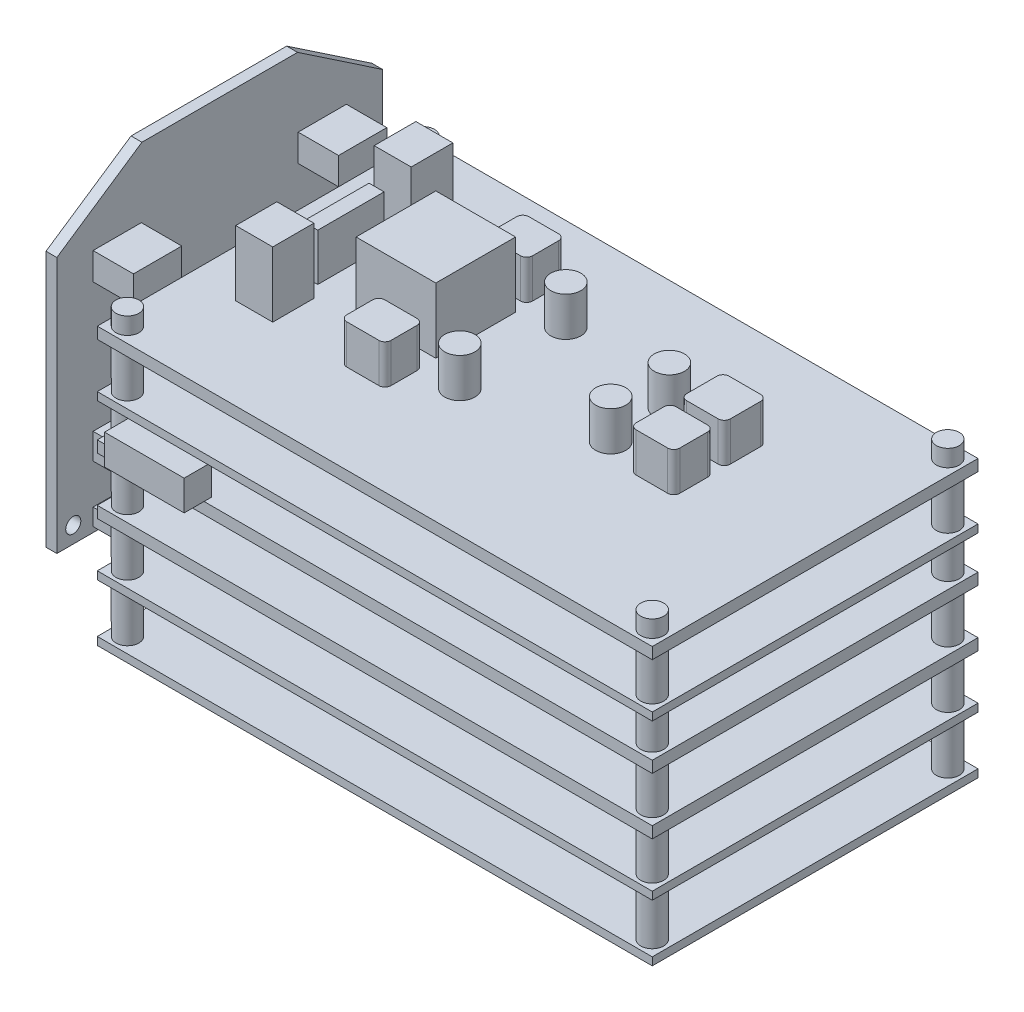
from build123d import *

# Parameters (mm, degrees)
SKETCH1_W                   = 116.84
SKETCH1_H                   = 1.651
BOSS_EXTRUDE1_DEPTH         = 68.58
SKETCH1_H_2                 = 2.413
BOSS_EXTRUDE1_2_DEPTH       = 68.58
BOSS_EXTRUDE1_3_DEPTH       = 68.58
BOSS_EXTRUDE1_4_DEPTH       = 68.58
BOSS_EXTRUDE1_5_DEPTH       = 68.58
BOSS_EXTRUDE1_6_DEPTH       = 68.58
BOSS_EXTRUDE2_DEPTH         = 3.556
BOSS_EXTRUDE2_DEPTH_BACK    = 68.58
SKETCH2_R                   = 2.413
SKETCH4_W                   = 10.16
SKETCH4_H                   = 5.715
BOSS_EXTRUDE4_DEPTH         = 8.509
BOSS_EXTRUDE4_2_DEPTH       = 8.509
SKETCH4_W_2                 = 53.34
SKETCH4_H_2                 = 3.550371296
BOSS_EXTRUDE4_3_DEPTH       = 8.509
SKETCH4_H_3                 = 5.423881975
BOSS_EXTRUDE4_4_DEPTH       = 8.509
SKETCH5_W                   = 68.58
SKETCH5_H                   = 53.975
SKETCH5_W_2                 = 53.34
SKETCH5_H_2                 = 5.423881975
BOSS_EXTRUDE5_DEPTH         = 2.286
SKETCH6_W                   = 22.86
SKETCH6_H                   = 20.701
SKETCH6_W_2                 = 17.78
BOSS_EXTRUDE6_DEPTH         = 5.588
SKETCH7_W                   = 22.86
SKETCH7_H                   = 5.386055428
SKETCH7_W_2                 = 17.78
CUT_EXTRUDE1_DEPTH          = 1.016
SKETCH8_W                   = 7.845965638
SKETCH8_H                   = 7.160395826
SKETCH8_W_2                 = 7.693616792
BOSS_EXTRUDE7_DEPTH         = 1.905
SKETCH9_W                   = 1.510704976
SKETCH9_H                   = 22.987
SKETCH9_H_2                 = 17.78
CUT_EXTRUDE2_DEPTH          = 5.386055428
SKETCH10_R                  = 0.972216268
SKETCH10_R_2                = 0.463831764
SKETCH10_R_3                = 0.431041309
BOSS_EXTRUDE8_DEPTH         = 19.05
SKETCH13_W                  = 3.175
SKETCH13_H                  = 13.97
SKETCH13_W_2                = 7.793819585
SKETCH13_H_2                = 8.783893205
SKETCH13_H_3                = 8.665749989
SKETCH13_W_3                = 16.791502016
SKETCH13_H_4                = 16.791502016
BOSS_EXTRUDE10_DEPTH        = 13.716
SKETCH14_W                  = 3.175
SKETCH14_H                  = 13.97
CUT_EXTRUDE3_DEPTH          = 3.81
SKETCH15_R                  = 3.175
BOSS_EXTRUDE11_DEPTH        = 8.255
JON_CUT_EXTRUDE4_DEPTH      = 129.850763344
JON_CUT_EXTRUDE4_DEPTH_BACK = 129.850763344
SKETCH16_W                  = 88.116714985
SKETCH16_H                  = 11.606165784
CONNECTOR_START             = -1.5875
SKETCH18_W                  = 16.764
SKETCH18_H                  = 6.35
CONNECTOR_REMOVED_DEPTH     = 5.7785
SKETCH19_R                  = 1.5875
CUT_EXTRUDE4_DEPTH          = 2.286


with BuildPart() as part:
    # Sketch1 → Boss-Extrude1 (new body)
    with BuildSketch(Plane.XY):
        with Locations((0, 45.466)):
            Rectangle(SKETCH1_W, SKETCH1_H)
    extrude(amount=-BOSS_EXTRUDE1_DEPTH)



with BuildPart() as body_2:
    # Sketch1 → Boss-Extrude1 2 (new body)
    with BuildSketch(Plane.XY):
        with Locations((0, 36.29025)):
            Rectangle(SKETCH1_W, SKETCH1_H_2)
    extrude(amount=-BOSS_EXTRUDE1_2_DEPTH)


with BuildPart() as body_3:
    # Sketch1 → Boss-Extrude1 3 (new body)
    with BuildSketch(Plane.XY):
        with Locations((0, 24.35225)):
            Rectangle(SKETCH1_W, SKETCH1_H_2)
    extrude(amount=-BOSS_EXTRUDE1_3_DEPTH)


with BuildPart() as body_4:
    # Sketch1 → Boss-Extrude1 4 (new body)
    with BuildSketch(Plane.XY):
        with Locations((0, 12.79525)):
            Rectangle(SKETCH1_W, SKETCH1_H)
    extrude(amount=-BOSS_EXTRUDE1_4_DEPTH)


with BuildPart() as body_5:
    # Sketch1 → Boss-Extrude1 5 (new body)
    with BuildSketch(Plane.XY):
        with Locations((0, 0.8255)):
            Rectangle(SKETCH1_W, SKETCH1_H)
    extrude(amount=-BOSS_EXTRUDE1_5_DEPTH)


with BuildPart() as body_6:
    # Sketch1 → Boss-Extrude1 6 (new body)
    with BuildSketch(Plane.XY):
        with Locations((0, 57.023)):
            Rectangle(SKETCH1_W, SKETCH1_H_2)
    extrude(amount=-BOSS_EXTRUDE1_6_DEPTH)


with BuildPart() as part_1:
    add(part.part)

    add(body_2.part)  # Boss-Extrude2 merges body 2

    add(body_3.part)  # Boss-Extrude2 merges body 3

    add(body_4.part)  # Boss-Extrude2 merges body 4

    add(body_5.part)  # Boss-Extrude2 merges body 5

    add(body_6.part)  # Boss-Extrude2 merges body 6
    # Sketch2 → Boss-Extrude2 (add, two sides: drawn at the far end of the back side and taken through both)
    with BuildSketch(Plane(origin=(0, 58.2295, 0), x_dir=(1, 0, 0), z_dir=(0, 1, 0)).offset(-BOSS_EXTRUDE2_DEPTH_BACK)):
        with Locations((-55.245, 65.405)):
            Circle(SKETCH2_R)
        with Locations((-55.245, 3.175)):
            Circle(SKETCH2_R)
        with Locations((55.245, 3.175)):
            Circle(SKETCH2_R)
        with Locations((55.245, 65.405)):
            Circle(SKETCH2_R)
    extrude(amount=BOSS_EXTRUDE2_DEPTH + BOSS_EXTRUDE2_DEPTH_BACK)

    # Sketch13 → Boss-Extrude10 (add)
    with BuildSketch(Plane(origin=(0, 58.2295, 0), x_dir=(1, 0, 0), z_dir=(0, 1, 0))):
        with Locations((-44.3865, 37.7825)):
            Rectangle(SKETCH13_W, SKETCH13_H)
        with Locations((-44.569924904, 52.730965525)):
            Rectangle(SKETCH13_W_2, SKETCH13_H_2)
        with Locations((-44.569924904, 23.523462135)):
            Rectangle(SKETCH13_W_2, SKETCH13_H_3)
        with Locations((-25.320858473, 38.172446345)):
            Rectangle(SKETCH13_W_3, SKETCH13_H_4)
    extrude(amount=BOSS_EXTRUDE10_DEPTH)

    # Sketch14 → Cut-Extrude3 (cut)
    with BuildSketch(Plane(origin=(0, 71.9455, 0), x_dir=(1, 0, 0), z_dir=(0, 1, 0))):
        with Locations((-44.3865, 37.7825)):
            Rectangle(SKETCH14_W, SKETCH14_H)
    extrude(amount=-CUT_EXTRUDE3_DEPTH, mode=Mode.SUBTRACT)

    # Sketch15 → Boss-Extrude11 (add)
    with BuildSketch(Plane(origin=(0, 58.2295, 0), x_dir=(1, 0, 0), z_dir=(0, 1, 0))):
        with Locations(Location((16.704753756, 45.31913635, 0), (0, 0, 180))):
            Circle(SKETCH15_R)
        with Locations(Location((16.704753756, 32.977007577, 0), (0, 0, 180))):
            Circle(SKETCH15_R)
        with Locations(Location((-8.898598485, 49.126814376, 0), (0, 0, 180))):
            Circle(SKETCH15_R)
        with Locations(Location((-8.898598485, 26.805943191, 0), (0, 0, 180))):
            Circle(SKETCH15_R)
        with BuildLine():
            Line((-24.697499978, 57.136068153), (-18.440450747, 57.136068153))
            ThreePointArc((-18.440450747, 57.136068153), (-17.542425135, 56.764093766), (-17.170450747, 55.866068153))
            Line((-17.170450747, 55.866068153), (-17.170450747, 50.396814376))
            ThreePointArc((-17.170450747, 50.396814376), (-17.542425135, 49.498788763), (-18.440450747, 49.126814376))
            Line((-18.440450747, 49.126814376), (-24.697499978, 49.126814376))
            ThreePointArc((-24.697499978, 49.126814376), (-25.595525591, 49.498788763), (-25.967499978, 50.396814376))
            Line((-25.967499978, 50.396814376), (-25.967499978, 55.866068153))
            ThreePointArc((-25.967499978, 55.866068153), (-25.595525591, 56.764093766), (-24.697499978, 57.136068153))
        make_face()
        with BuildLine():
            Line((-24.697499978, 26.805943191), (-17.915253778, 26.805943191))
            ThreePointArc((-17.915253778, 26.805943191), (-17.017228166, 26.433968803), (-16.645253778, 25.535943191))
            Line((-16.645253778, 25.535943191), (-16.645253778, 20.066689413))
            ThreePointArc((-16.645253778, 20.066689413), (-17.017228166, 19.168663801), (-17.915253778, 18.796689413))
            Line((-17.915253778, 18.796689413), (-24.697499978, 18.796689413))
            ThreePointArc((-24.697499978, 18.796689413), (-25.595525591, 19.168663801), (-25.967499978, 20.066689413))
            Line((-25.967499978, 20.066689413), (-25.967499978, 25.535943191))
            ThreePointArc((-25.967499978, 25.535943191), (-25.595525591, 26.433968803), (-24.697499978, 26.805943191))
        make_face()
        with BuildLine():
            Line((25.458810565, 49.126814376), (32.109757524, 49.126814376))
            ThreePointArc((32.109757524, 49.126814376), (33.007783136, 48.754839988), (33.379757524, 47.856814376))
            Line((33.379757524, 47.856814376), (33.379757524, 41.468465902))
            ThreePointArc((33.379757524, 41.468465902), (33.007783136, 40.57044029), (32.109757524, 40.198465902))
            Line((32.109757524, 40.198465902), (25.458810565, 40.198465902))
            ThreePointArc((25.458810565, 40.198465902), (24.560784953, 40.57044029), (24.188810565, 41.468465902))
            Line((24.188810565, 41.468465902), (24.188810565, 47.856814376))
            ThreePointArc((24.188810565, 47.856814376), (24.560784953, 48.754839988), (25.458810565, 49.126814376))
        make_face()
        with BuildLine():
            Line((25.458810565, 37.966378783), (32.109757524, 37.966378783))
            ThreePointArc((32.109757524, 37.966378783), (33.007783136, 37.594404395), (33.379757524, 36.696378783))
            Line((33.379757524, 36.696378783), (33.379757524, 30.833227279))
            ThreePointArc((33.379757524, 30.833227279), (33.007783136, 29.935201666), (32.109757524, 29.563227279))
            Line((32.109757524, 29.563227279), (25.458810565, 29.563227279))
            ThreePointArc((25.458810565, 29.563227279), (24.560784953, 29.935201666), (24.188810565, 30.833227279))
            Line((24.188810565, 30.833227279), (24.188810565, 36.696378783))
            ThreePointArc((24.188810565, 36.696378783), (24.560784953, 37.594404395), (25.458810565, 37.966378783))
        make_face()
    extrude(amount=BOSS_EXTRUDE11_DEPTH)

    # Sketch16 → Jon_Cut-Extrude4 (cut, two sides: drawn at the far end of the back side and taken through both)
    with BuildSketch(Plane(origin=(0, 0, 0), x_dir=(0, 0, -1), z_dir=(1, 0, 0)).offset(-JON_CUT_EXTRUDE4_DEPTH_BACK)):
        with Locations((37.269078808, -5.828482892)):
            Rectangle(SKETCH16_W, SKETCH16_H)
    extrude(amount=JON_CUT_EXTRUDE4_DEPTH + JON_CUT_EXTRUDE4_DEPTH_BACK, mode=Mode.SUBTRACT)

    # Sketch18 → connector removed (add)
    with BuildSketch(Plane.XY.offset(CONNECTOR_START)):
        with Locations((-44.323, 40.67175)):
            Rectangle(SKETCH18_W, SKETCH18_H)
    extrude(amount=CONNECTOR_REMOVED_DEPTH)


with BuildPart() as body_2_2:
    # Sketch4 → Boss-Extrude4 (new body)
    with BuildSketch(Plane.ZY.offset(58.42)):
        with Locations((-55.88, 61.087)):
            Rectangle(SKETCH4_W, SKETCH4_H)
    extrude(amount=BOSS_EXTRUDE4_DEPTH)



with BuildPart() as body_3_2:
    # Sketch4 → Boss-Extrude4 2 (new body)
    with BuildSketch(Plane.ZY.offset(58.42)):
        with Locations((-12.7, 61.087)):
            Rectangle(SKETCH4_W, SKETCH4_H)
    extrude(amount=BOSS_EXTRUDE4_2_DEPTH)


with BuildPart() as body_4_2:
    # Sketch4 → Boss-Extrude4 3 (new body)
    with BuildSketch(Plane.ZY.offset(58.42)):
        with Locations((-34.29, 15.395935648)):
            Rectangle(SKETCH4_W_2, SKETCH4_H_2)
    extrude(amount=BOSS_EXTRUDE4_3_DEPTH)


with BuildPart() as body_5_2:
    # Sketch4 → Boss-Extrude4 4 (new body)
    with BuildSketch(Plane.ZY.offset(58.42)):
        with Locations((-34.29, 28.270690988)):
            Rectangle(SKETCH4_W_2, SKETCH4_H_3)
    extrude(amount=BOSS_EXTRUDE4_4_DEPTH)


with BuildPart() as body_2_2_1:
    add(body_2_2.part)

    add(body_3_2.part)  # Boss-Extrude5 merges body 3 2

    add(body_4_2.part)  # Boss-Extrude5 merges body 4 2
    # Sketch5 → Boss-Extrude5 (add)
    # profile 1 of 3: a face of its own
    with BuildSketch(Plane.ZY.offset(66.929)):
        with Locations((-34.29, 39.497)):
            Rectangle(SKETCH5_W, SKETCH5_H)
        with Locations((-34.29, 28.270690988)):
            Rectangle(SKETCH5_W_2, SKETCH5_H_2, mode=Mode.SUBTRACT)
    # profile 2 of 3: a face of its own
    with BuildSketch(Plane.ZY.offset(66.929)):
        Polygon((-17.907, 78.5495), (0, 66.4845), (-68.58, 66.4845), (-50.673, 78.5495), align=None)
    # profile 3 of 3: a face of its own
    with BuildSketch(Plane.ZY.offset(66.929)):
        with Locations((-34.29, 28.270690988)):
            Rectangle(SKETCH5_W_2, SKETCH5_H_2)
    extrude(amount=BOSS_EXTRUDE5_DEPTH)

    # Sketch6 → Boss-Extrude6 (add)
    with BuildSketch(Plane.ZY.offset(69.215)):
        with Locations((-57.023, 39.751)):
            Rectangle(SKETCH6_W, SKETCH6_H)
        with Locations((-34.163, 39.751)):
            Rectangle(SKETCH6_W_2, SKETCH6_H)
    extrude(amount=BOSS_EXTRUDE6_DEPTH)

    # Sketch7 → Cut-Extrude1 (cut)
    with BuildSketch(Plane.ZY.offset(74.803)):
        with Locations((-57.023, 32.093527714)):
            Rectangle(SKETCH7_W, SKETCH7_H)
        with Locations((-34.163, 32.093527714)):
            Rectangle(SKETCH7_W_2, SKETCH7_H)
    extrude(amount=-CUT_EXTRUDE1_DEPTH, mode=Mode.SUBTRACT)

    # Sketch8 → Boss-Extrude7 (add)
    with BuildSketch(Plane.ZY.offset(73.787)):
        with Locations((-57.069152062, 36.231773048)):
            Rectangle(SKETCH8_W, SKETCH8_H)
        with Locations((-34.140650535, 36.231773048)):
            Rectangle(SKETCH8_W_2, SKETCH8_H)
    extrude(amount=BOSS_EXTRUDE7_DEPTH)

    # Sketch9 → Cut-Extrude2 (cut)
    with BuildSketch(Plane.XZ.offset(-29.4005)):
        with Locations((-69.970352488, -57.0865)):
            Rectangle(SKETCH9_W, SKETCH9_H)
        with Locations((-69.970352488, -34.163)):
            Rectangle(SKETCH9_W, SKETCH9_H_2)
    extrude(amount=-CUT_EXTRUDE2_DEPTH, mode=Mode.SUBTRACT)

    # Sketch10 → Boss-Extrude8 (add)
    with BuildSketch(Plane.XZ.offset(-29.4005)):
        with Locations(Location((-72.256352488, -66.448736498, 0), (0, 0, 180))):
            Circle(SKETCH10_R)
        with Locations(Location((-72.256352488, -63.908736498, 0), (0, 0, 180))):
            Circle(SKETCH10_R)
        with Locations(Location((-72.256352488, -61.368736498, 0), (0, 0, 180))):
            Circle(SKETCH10_R)
        with Locations(Location((-72.256352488, -58.828736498, 0), (0, 0, 180))):
            Circle(SKETCH10_R)
        with Locations(Location((-72.256352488, -56.288736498, 0), (0, 0, 180))):
            Circle(SKETCH10_R)
        with Locations(Location((-72.256352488, -53.748736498, 0), (0, 0, 180))):
            Circle(SKETCH10_R)
        with Locations(Location((-72.256352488, -51.208736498, 0), (0, 0, 180))):
            Circle(SKETCH10_R)
        with Locations(Location((-72.256352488, -48.668736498, 0), (0, 0, 180))):
            Circle(SKETCH10_R)
        with Locations(Location((-72.256352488, -41.652588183, 0), (0, 0, 180))):
            Circle(SKETCH10_R_2)
        with Locations(Location((-72.256352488, -40.016108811, 0), (0, 0, 180))):
            Circle(SKETCH10_R_3)
    extrude(amount=BOSS_EXTRUDE8_DEPTH)

    # Sketch19 → Cut-Extrude4 (cut)
    with BuildSketch(Plane.ZY.offset(69.215)):
        with Locations(Location((-3.4544, 15.9639, 0), (0, 0, 270))):
            Circle(SKETCH19_R)
        with Locations(Location((-65.120987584, 15.9639, 0), (0, 0, 270))):
            Circle(SKETCH19_R)
    extrude(amount=-CUT_EXTRUDE4_DEPTH, mode=Mode.SUBTRACT)


solid = Compound([part_1.part, body_5_2.part, body_2_2_1.part])
